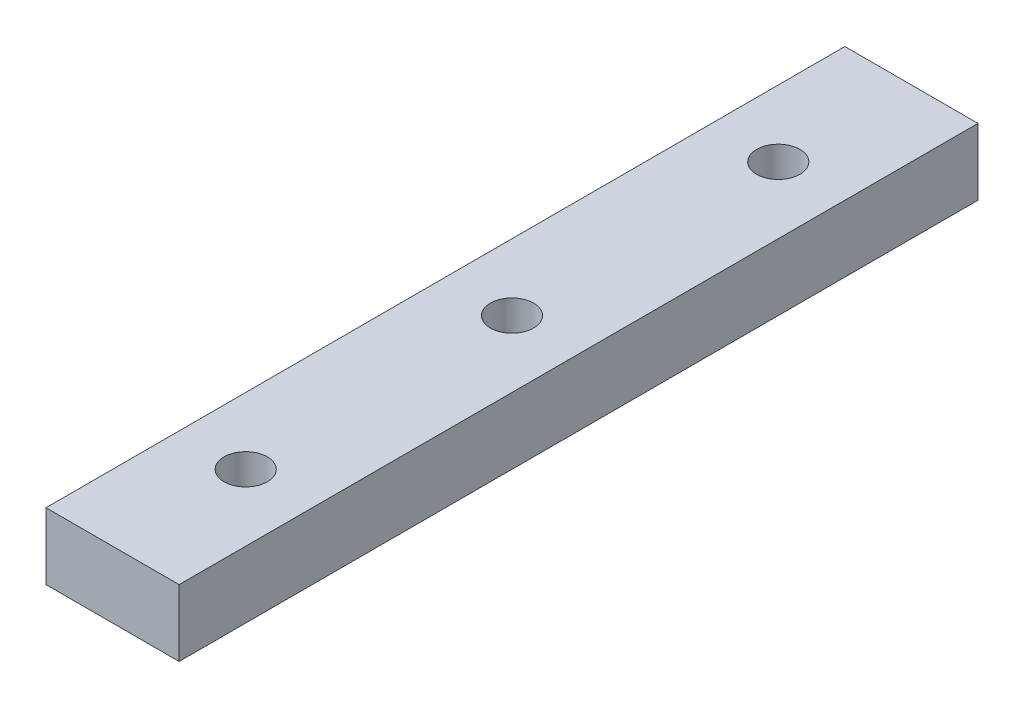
from build123d import *

# Parameters (mm, degrees)
ESQUISSE1_W                    = 20
ESQUISSE1_H                    = 10
EXTRUSION1_DEPTH               = 120
ESQUISSE3_R                    = 3.25
ENL_V_MAT_EXTRU_1_DEPTH        = 10
R_P_TITION_LIN_AIRE1_COUNT     = 2
R_P_TITION_LIN_AIRE1_PITCH     = 40
R_P_TITION_LIN_AIRE1_COL_COUNT = 2
R_P_TITION_LIN_AIRE1_COL_PITCH = 40


with BuildPart() as part:
    # Esquisse1 → Extrusion1 (new body)
    with BuildSketch(Plane.XY):
        with Locations((10, 5)):
            Rectangle(ESQUISSE1_W, ESQUISSE1_H)
    extrude(amount=-EXTRUSION1_DEPTH)

    # Esquisse3 → Enl_v. mat.-Extru.1 (cut)
    with BuildSketch(Plane(origin=(0, 10, 0), x_dir=(-1, 0, 0), z_dir=(0, 1, 0))):
        with Locations(Location((-10, -60, 0), (0, 0, 90))):
            Circle(ESQUISSE3_R)
    enl_v_mat_extru_1 = extrude(amount=-ENL_V_MAT_EXTRU_1_DEPTH, mode=Mode.SUBTRACT)

    # R_p_tition lin_aire1: Enl_v. mat.-Extru.1 ×2
    with Locations(*[(0, 0, i * R_P_TITION_LIN_AIRE1_PITCH) for i in range(1, R_P_TITION_LIN_AIRE1_COUNT)]):
        add(enl_v_mat_extru_1, mode=Mode.SUBTRACT)

    # R_p_tition lin_aire1 col: Enl_v. mat.-Extru.1 ×2
    with Locations(*[(0, 0, -i * R_P_TITION_LIN_AIRE1_COL_PITCH) for i in range(1, R_P_TITION_LIN_AIRE1_COL_COUNT)]):
        add(enl_v_mat_extru_1, mode=Mode.SUBTRACT)


solid = part.part
